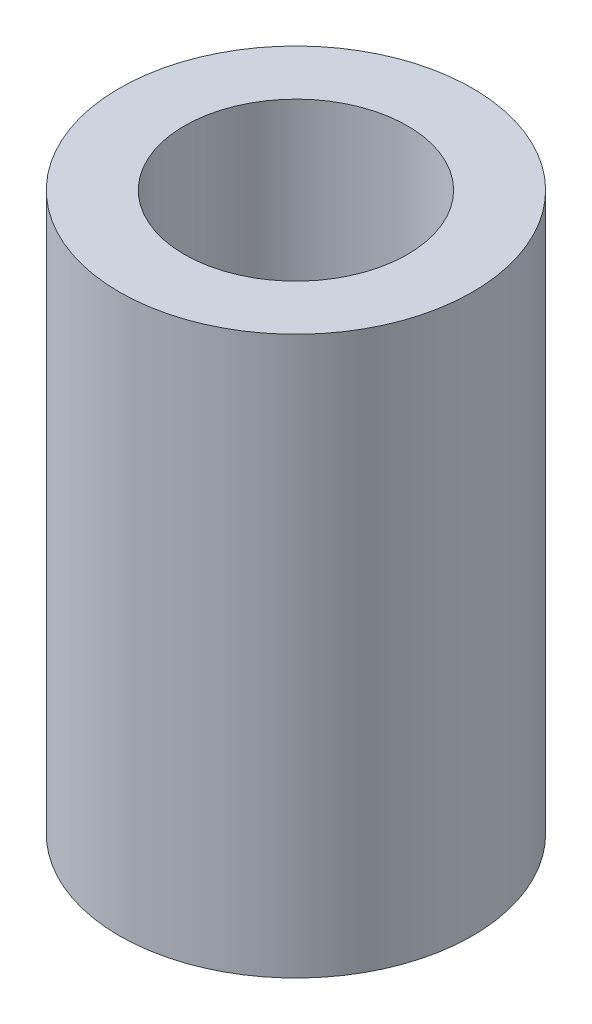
from build123d import *

# Parameters (mm, degrees)
ESQUISSE1_R      = 9.5
ESQUISSE1_R_2    = 6
EXTRUSION1_DEPTH = 30


with BuildPart() as part:
    # Esquisse1 → Extrusion1 (new body)
    with BuildSketch(Plane(origin=(0, 0, 0), x_dir=(1, 0, 0), z_dir=(0, 1, 0))):
        with Locations(Location((0, 0, 0), (0, 0, 270))):
            Circle(ESQUISSE1_R)
        with Locations(Location((0, 0, 0), (0, 0, 270))):
            Circle(ESQUISSE1_R_2, mode=Mode.SUBTRACT)
    extrude(amount=EXTRUSION1_DEPTH)


solid = part.part
